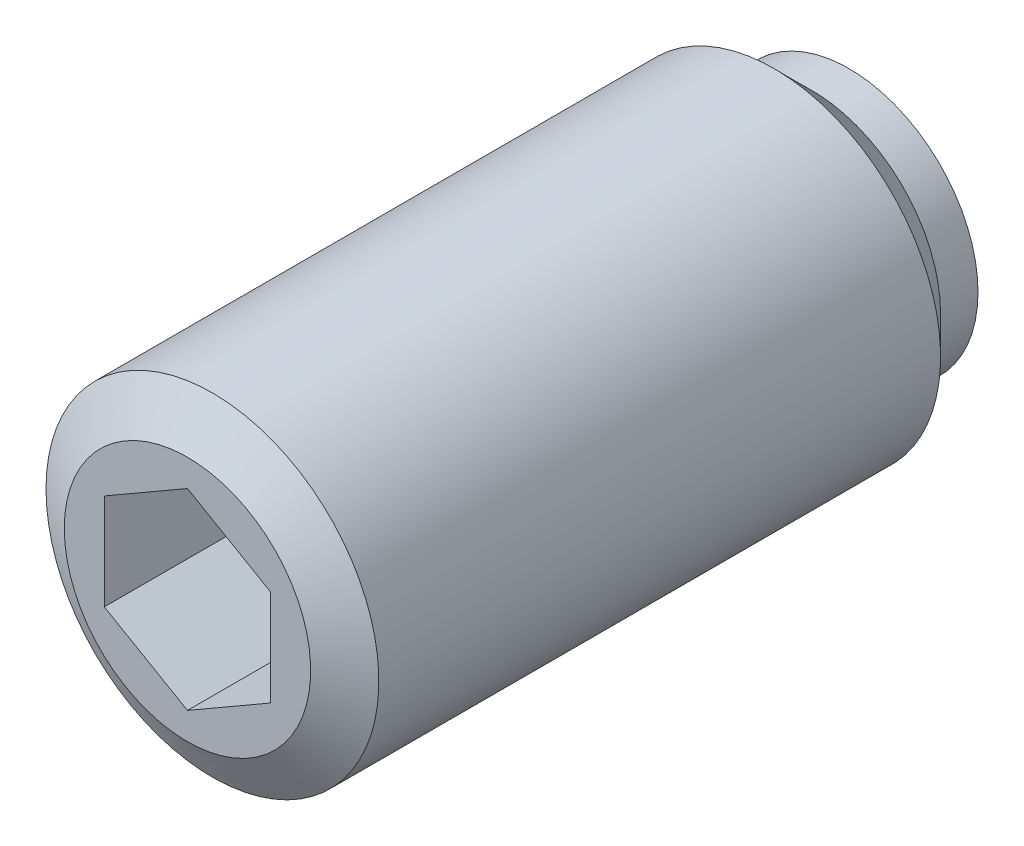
ISO-10303-21;
HEADER;
FILE_DESCRIPTION(('STEP AP214'),'2;1');
FILE_NAME('part.step','',(''),(''),'','','');
FILE_SCHEMA(('AUTOMOTIVE_DESIGN { 1 0 10303 214 1 1 1 1 }'));
ENDSEC;
DATA;
#1=APPLICATION_CONTEXT('core data for automotive mechanical design processes');
#2=APPLICATION_PROTOCOL_DEFINITION('international standard','automotive_design',2000,#1);
#3=PRODUCT_CONTEXT('',#1,'mechanical');
#4=PRODUCT('Part','Part','',(#3));
#5=PRODUCT_RELATED_PRODUCT_CATEGORY('part','',(#4));
#6=PRODUCT_DEFINITION_FORMATION('','',#4);
#7=PRODUCT_DEFINITION_CONTEXT('part definition',#1,'design');
#8=PRODUCT_DEFINITION('design','',#6,#7);
#9=PRODUCT_DEFINITION_SHAPE('','',#8);
#10=(LENGTH_UNIT() NAMED_UNIT(*) SI_UNIT(.MILLI.,.METRE.));
#11=(NAMED_UNIT(*) PLANE_ANGLE_UNIT() SI_UNIT($,.RADIAN.));
#12=(NAMED_UNIT(*) SI_UNIT($,.STERADIAN.) SOLID_ANGLE_UNIT());
#13=UNCERTAINTY_MEASURE_WITH_UNIT(LENGTH_MEASURE(1.E-05),#10,'distance_accuracy_value','');
#14=(GEOMETRIC_REPRESENTATION_CONTEXT(3) GLOBAL_UNCERTAINTY_ASSIGNED_CONTEXT((#13)) GLOBAL_UNIT_ASSIGNED_CONTEXT((#10,
#11,#12)) REPRESENTATION_CONTEXT('',''));
#15=CARTESIAN_POINT('',(0.,0.,0.));
#16=DIRECTION('',(0.,0.,1.));
#17=DIRECTION('',(1.,0.,0.));
#18=AXIS2_PLACEMENT_3D('',#15,#16,#17);
#19=CARTESIAN_POINT('',(0.,2.09621086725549,0.));
#20=DIRECTION('',(0.,0.,1.));
#21=DIRECTION('',(-1.,0.,0.));
#22=AXIS2_PLACEMENT_3D('',#19,#20,#21);
#23=PLANE('',#22);
#24=CARTESIAN_POINT('',(0.,0.,0.));
#25=DIRECTION('',(0.,0.,1.));
#26=DIRECTION('',(-1.,0.,0.));
#27=AXIS2_PLACEMENT_3D('',#24,#25,#26);
#28=CIRCLE('',#27,2.09621086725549);
#29=CARTESIAN_POINT('',(0.,2.09621086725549,0.));
#30=VERTEX_POINT('',#29);
#31=EDGE_CURVE('E9',#30,#30,#28,.T.);
#32=ORIENTED_EDGE('',*,*,#31,.F.);
#33=EDGE_LOOP('',(#32));
#34=FACE_BOUND('',#33,.T.);
#35=ADVANCED_FACE('F14',(#34),#23,.F.);
#36=CARTESIAN_POINT('',(0.,0.,1.78));
#37=DIRECTION('',(0.,0.,1.));
#38=DIRECTION('',(0.,1.,0.));
#39=AXIS2_PLACEMENT_3D('',#36,#37,#38);
#40=SPHERICAL_SURFACE('',#39,2.75);
#41=CARTESIAN_POINT('',(0.,0.,0.5));
#42=DIRECTION('',(0.,0.,1.));
#43=DIRECTION('',(-1.,0.,0.));
#44=AXIS2_PLACEMENT_3D('',#41,#42,#43);
#45=CIRCLE('',#44,2.43394741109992);
#46=CARTESIAN_POINT('',(0.,2.43394741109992,0.5));
#47=VERTEX_POINT('',#46);
#48=EDGE_CURVE('E21',#47,#47,#45,.T.);
#49=CARTESIAN_POINT('',(0.,2.43394741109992,0.5));
#50=CARTESIAN_POINT('',(0.,2.43101603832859,0.494425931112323));
#51=CARTESIAN_POINT('',(0.,2.42806551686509,0.488861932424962));
#52=CARTESIAN_POINT('',(0.,2.42212631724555,0.477754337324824));
#53=CARTESIAN_POINT('',(0.,2.41913763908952,0.472210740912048));
#54=CARTESIAN_POINT('',(0.,2.41312226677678,0.46114421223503));
#55=CARTESIAN_POINT('',(0.,2.41009557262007,0.455621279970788));
#56=CARTESIAN_POINT('',(0.,2.40400431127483,0.444596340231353));
#57=CARTESIAN_POINT('',(0.,2.40093974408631,0.439094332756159));
#58=CARTESIAN_POINT('',(0.,2.39477288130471,0.428111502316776));
#59=CARTESIAN_POINT('',(0.,2.39167058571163,0.422630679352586));
#60=CARTESIAN_POINT('',(0.,2.38542841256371,0.411690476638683));
#61=CARTESIAN_POINT('',(0.,2.38228853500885,0.40623109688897));
#62=CARTESIAN_POINT('',(0.,2.37597134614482,0.39533403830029));
#63=CARTESIAN_POINT('',(0.,2.37279403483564,0.389896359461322));
#64=CARTESIAN_POINT('',(0.,2.36640212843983,0.379042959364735));
#65=CARTESIAN_POINT('',(0.,2.3631875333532,0.373627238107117));
#66=CARTESIAN_POINT('',(0.,2.35672121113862,0.362818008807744));
#67=CARTESIAN_POINT('',(0.,2.35346948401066,0.35742450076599));
#68=CARTESIAN_POINT('',(0.,2.3469290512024,0.346659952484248));
#69=CARTESIAN_POINT('',(0.,2.3436403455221,0.341288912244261));
#70=CARTESIAN_POINT('',(0.,2.3370261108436,0.330569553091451));
#71=CARTESIAN_POINT('',(0.,2.33370058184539,0.325221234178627));
#72=CARTESIAN_POINT('',(0.,2.32701285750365,0.314547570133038));
#73=CARTESIAN_POINT('',(0.,2.32365066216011,0.309222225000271));
#74=CARTESIAN_POINT('',(0.,2.31688976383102,0.298594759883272));
#75=CARTESIAN_POINT('',(0.,2.31349106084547,0.293292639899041));
#76=CARTESIAN_POINT('',(0.,2.30665730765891,0.28271187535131));
#77=CARTESIAN_POINT('',(0.,2.30322225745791,0.277433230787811));
#78=CARTESIAN_POINT('',(0.,2.29631597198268,0.266899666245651));
#79=CARTESIAN_POINT('',(0.,2.29284473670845,0.261644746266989));
#80=CARTESIAN_POINT('',(0.,2.28586624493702,0.251158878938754));
#81=CARTESIAN_POINT('',(0.,2.28235898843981,0.24592793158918));
#82=CARTESIAN_POINT('',(0.,2.27530861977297,0.235490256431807));
#83=CARTESIAN_POINT('',(0.,2.27176550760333,0.230283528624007));
#84=CARTESIAN_POINT('',(0.,2.26464359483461,0.219894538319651));
#85=CARTESIAN_POINT('',(0.,2.26106479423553,0.214712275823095));
#86=CARTESIAN_POINT('',(0.,2.25387167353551,0.204372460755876));
#87=CARTESIAN_POINT('',(0.,2.25025735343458,0.199214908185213));
#88=CARTESIAN_POINT('',(0.,2.24299336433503,0.188924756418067));
#89=CARTESIAN_POINT('',(0.,2.23934369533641,0.183792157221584));
#90=CARTESIAN_POINT('',(0.,2.23200918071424,0.173552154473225));
#91=CARTESIAN_POINT('',(0.,2.22832433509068,0.168444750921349));
#92=CARTESIAN_POINT('',(0.,2.22091964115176,0.158255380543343));
#93=CARTESIAN_POINT('',(0.,2.2171997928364,0.153173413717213));
#94=CARTESIAN_POINT('',(0.,2.20972526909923,0.143035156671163));
#95=CARTESIAN_POINT('',(0.,2.20597059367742,0.137978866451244));
#96=CARTESIAN_POINT('',(0.,2.19842659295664,0.127892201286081));
#97=CARTESIAN_POINT('',(0.,2.19463726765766,0.122861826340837));
#98=CARTESIAN_POINT('',(0.,2.18702414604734,0.112827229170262));
#99=CARTESIAN_POINT('',(0.,2.183200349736,0.10782300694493));
#100=CARTESIAN_POINT('',(0.,2.17551846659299,0.0978409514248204));
#101=CARTESIAN_POINT('',(0.,2.17166037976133,0.0928631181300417));
#102=CARTESIAN_POINT('',(0.,2.16391009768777,0.0829340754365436));
#103=CARTESIAN_POINT('',(0.,2.16001790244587,0.0779828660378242));
#104=CARTESIAN_POINT('',(0.,2.15219958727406,0.0681073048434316));
#105=CARTESIAN_POINT('',(0.,2.14827346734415,0.0631829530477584));
#106=CARTESIAN_POINT('',(0.,2.14038748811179,0.0533613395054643));
#107=CARTESIAN_POINT('',(0.,2.13642762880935,0.0484640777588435));
#108=CARTESIAN_POINT('',(0.,2.12847435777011,0.0386968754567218));
#109=CARTESIAN_POINT('',(0.,2.12448094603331,0.0338269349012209));
#110=CARTESIAN_POINT('',(0.,2.11646075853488,0.024114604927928));
#111=CARTESIAN_POINT('',(0.,2.11243398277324,0.019272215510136));
#112=CARTESIAN_POINT('',(0.,2.10434725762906,0.0096152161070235));
#113=CARTESIAN_POINT('',(0.,2.10028730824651,0.00480060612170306));
#114=CARTESIAN_POINT('',(0.,2.09621086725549,0.));
#115=B_SPLINE_CURVE_WITH_KNOTS('',3,(#49,#50,#51,#52,#53,#54,#55,#56,#57,#58,#59,#60,#61,#62,
#63,#64,#65,#66,#67,#68,#69,#70,#71,#72,#73,#74,#75,#76,#77,#78,#79,#80,#81,#82,#83,#84,#85,#86,
#87,#88,#89,#90,#91,#92,#93,#94,#95,#96,#97,#98,#99,#100,#101,#102,#103,#104,#105,#106,#107,
#108,#109,#110,#111,#112,#113,#114),.UNSPECIFIED.,.F.,.F.,(4,2,2,2,2,2,2,2,2,2,2,2,2,2,2,2,2,2,
2,2,2,2,2,2,2,2,2,2,2,2,2,2,4),(0.,0.0188935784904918,0.0377871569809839,0.0566807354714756,
0.0755743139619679,0.0944678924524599,0.113361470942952,0.132255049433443,0.151148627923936,
0.170042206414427,0.188935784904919,0.207829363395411,0.226722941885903,0.245616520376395,
0.264510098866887,0.283403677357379,0.302297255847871,0.321190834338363,0.340084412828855,
0.358977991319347,0.377871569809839,0.396765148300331,0.415658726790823,0.434552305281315,
0.453445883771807,0.472339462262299,0.491233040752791,0.510126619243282,0.529020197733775,
0.547913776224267,0.566807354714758,0.58570093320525,0.604594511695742),.UNSPECIFIED.);
#116=EDGE_CURVE('BSEAM141',#47,#30,#115,.T.);
#117=ORIENTED_EDGE('',*,*,#48,.F.);
#118=ORIENTED_EDGE('',*,*,#31,.T.);
#119=ORIENTED_EDGE('',*,*,#116,.T.);
#120=ORIENTED_EDGE('',*,*,#116,.F.);
#121=EDGE_LOOP('',(#117,#119,#118,#120));
#122=FACE_BOUND('',#121,.T.);
#123=ADVANCED_FACE('F141',(#122),#40,.T.);
#124=CARTESIAN_POINT('',(0.,3.1,0.5));
#125=DIRECTION('',(0.,0.,1.));
#126=DIRECTION('',(-1.,0.,0.));
#127=AXIS2_PLACEMENT_3D('',#124,#125,#126);
#128=PLANE('',#127);
#129=CARTESIAN_POINT('',(0.,0.,0.5));
#130=DIRECTION('',(0.,0.,1.));
#131=DIRECTION('',(-1.,0.,0.));
#132=AXIS2_PLACEMENT_3D('',#129,#130,#131);
#133=CIRCLE('',#132,3.1);
#134=CARTESIAN_POINT('',(-3.1,0.,0.5));
#135=VERTEX_POINT('',#134);
#136=EDGE_CURVE('E134',#135,#135,#133,.T.);
#137=ORIENTED_EDGE('',*,*,#136,.F.);
#138=EDGE_LOOP('',(#137));
#139=FACE_BOUND('',#138,.T.);
#140=ORIENTED_EDGE('',*,*,#48,.T.);
#141=EDGE_LOOP('',(#140));
#142=FACE_BOUND('',#141,.T.);
#143=ADVANCED_FACE('F139',(#139,#142),#128,.F.);
#144=CARTESIAN_POINT('',(0.,0.,17.7950749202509));
#145=DIRECTION('',(0.,0.,1.));
#146=DIRECTION('',(-1.,0.,0.));
#147=AXIS2_PLACEMENT_3D('',#144,#145,#146);
#148=CYLINDRICAL_SURFACE('',#147,3.1);
#149=CARTESIAN_POINT('',(0.,0.,1.4));
#150=DIRECTION('',(0.,0.,1.));
#151=DIRECTION('',(-1.,0.,0.));
#152=AXIS2_PLACEMENT_3D('',#149,#150,#151);
#153=CIRCLE('',#152,3.1);
#154=CARTESIAN_POINT('',(-3.1,0.,1.4));
#155=VERTEX_POINT('',#154);
#156=EDGE_CURVE('E131',#155,#155,#153,.T.);
#157=ORIENTED_EDGE('',*,*,#156,.F.);
#158=EDGE_LOOP('',(#157));
#159=FACE_BOUND('',#158,.T.);
#160=ORIENTED_EDGE('',*,*,#136,.T.);
#161=EDGE_LOOP('',(#160));
#162=FACE_BOUND('',#161,.T.);
#163=ADVANCED_FACE('F164',(#159,#162),#148,.T.);
#164=CARTESIAN_POINT('',(0.,0.,1.4));
#165=DIRECTION('',(0.,0.,1.));
#166=DIRECTION('',(-1.,0.,0.));
#167=AXIS2_PLACEMENT_3D('',#164,#165,#166);
#168=CONICAL_SURFACE('',#167,3.1,0.78539816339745);
#169=CARTESIAN_POINT('',(0.,0.,2.3));
#170=DIRECTION('',(0.,0.,1.));
#171=DIRECTION('',(-1.,0.,0.));
#172=AXIS2_PLACEMENT_3D('',#169,#170,#171);
#173=CIRCLE('',#172,4.);
#174=CARTESIAN_POINT('',(-4.,0.,2.3));
#175=VERTEX_POINT('',#174);
#176=EDGE_CURVE('E128',#175,#175,#173,.T.);
#177=ORIENTED_EDGE('',*,*,#176,.F.);
#178=EDGE_LOOP('',(#177));
#179=FACE_BOUND('',#178,.T.);
#180=ORIENTED_EDGE('',*,*,#156,.T.);
#181=EDGE_LOOP('',(#180));
#182=FACE_BOUND('',#181,.T.);
#183=ADVANCED_FACE('F173',(#179,#182),#168,.T.);
#184=CARTESIAN_POINT('',(0.,0.,17.7950749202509));
#185=DIRECTION('',(0.,0.,1.));
#186=DIRECTION('',(-1.,0.,0.));
#187=AXIS2_PLACEMENT_3D('',#184,#185,#186);
#188=CYLINDRICAL_SURFACE('',#187,4.);
#189=CARTESIAN_POINT('',(0.,0.,15.8));
#190=DIRECTION('',(0.,0.,1.));
#191=DIRECTION('',(-1.,0.,0.));
#192=AXIS2_PLACEMENT_3D('',#189,#190,#191);
#193=CIRCLE('',#192,4.);
#194=CARTESIAN_POINT('',(-4.,0.,15.8));
#195=VERTEX_POINT('',#194);
#196=EDGE_CURVE('E125',#195,#195,#193,.T.);
#197=ORIENTED_EDGE('',*,*,#196,.F.);
#198=EDGE_LOOP('',(#197));
#199=FACE_BOUND('',#198,.T.);
#200=ORIENTED_EDGE('',*,*,#176,.T.);
#201=EDGE_LOOP('',(#200));
#202=FACE_BOUND('',#201,.T.);
#203=ADVANCED_FACE('F182',(#199,#202),#188,.T.);
#204=CARTESIAN_POINT('',(0.,0.,15.8));
#205=DIRECTION('',(0.,0.,-1.));
#206=DIRECTION('',(1.,0.,0.));
#207=AXIS2_PLACEMENT_3D('',#204,#205,#206);
#208=CONICAL_SURFACE('',#207,4.,1.04719755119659);
#209=CARTESIAN_POINT('',(0.,0.,16.4));
#210=DIRECTION('',(0.,0.,1.));
#211=DIRECTION('',(-1.,0.,0.));
#212=AXIS2_PLACEMENT_3D('',#209,#210,#211);
#213=CIRCLE('',#212,2.9607695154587);
#214=CARTESIAN_POINT('',(-2.9607695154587,0.,16.4));
#215=VERTEX_POINT('',#214);
#216=EDGE_CURVE('E116',#215,#215,#213,.T.);
#217=ORIENTED_EDGE('',*,*,#216,.F.);
#218=EDGE_LOOP('',(#217));
#219=FACE_BOUND('',#218,.T.);
#220=ORIENTED_EDGE('',*,*,#196,.T.);
#221=EDGE_LOOP('',(#220));
#222=FACE_BOUND('',#221,.T.);
#223=ADVANCED_FACE('F191',(#219,#222),#208,.T.);
#224=CARTESIAN_POINT('',(0.,0.,16.4));
#225=DIRECTION('',(0.,0.,-1.));
#226=DIRECTION('',(1.,0.,0.));
#227=AXIS2_PLACEMENT_3D('',#224,#225,#226);
#228=PLANE('',#227);
#229=DIRECTION('',(-0.866025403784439,-0.5,0.));
#230=VECTOR('',#229,1.);
#231=CARTESIAN_POINT('',(0.,2.30940107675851,16.4));
#232=LINE('',#231,#230);
#233=CARTESIAN_POINT('',(0.,2.30940107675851,16.4));
#234=VERTEX_POINT('',#233);
#235=CARTESIAN_POINT('',(-2.,1.15470053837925,16.4));
#236=VERTEX_POINT('',#235);
#237=EDGE_CURVE('E82',#234,#236,#232,.T.);
#238=ORIENTED_EDGE('',*,*,#237,.F.);
#239=DIRECTION('',(-0.866025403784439,0.5,0.));
#240=VECTOR('',#239,1.);
#241=CARTESIAN_POINT('',(2.,1.15470053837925,16.4));
#242=LINE('',#241,#240);
#243=CARTESIAN_POINT('',(2.,1.15470053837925,16.4));
#244=VERTEX_POINT('',#243);
#245=EDGE_CURVE('E28',#244,#234,#242,.T.);
#246=ORIENTED_EDGE('',*,*,#245,.F.);
#247=DIRECTION('',(0.,1.,0.));
#248=VECTOR('',#247,1.);
#249=CARTESIAN_POINT('',(2.,-1.15470053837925,16.4));
#250=LINE('',#249,#248);
#251=CARTESIAN_POINT('',(2.,-1.15470053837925,16.4));
#252=VERTEX_POINT('',#251);
#253=EDGE_CURVE('E98',#252,#244,#250,.T.);
#254=ORIENTED_EDGE('',*,*,#253,.F.);
#255=DIRECTION('',(0.866025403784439,0.5,0.));
#256=VECTOR('',#255,1.);
#257=CARTESIAN_POINT('',(0.,-2.30940107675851,16.4));
#258=LINE('',#257,#256);
#259=CARTESIAN_POINT('',(0.,-2.30940107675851,16.4));
#260=VERTEX_POINT('',#259);
#261=EDGE_CURVE('E92',#260,#252,#258,.T.);
#262=ORIENTED_EDGE('',*,*,#261,.F.);
#263=DIRECTION('',(0.866025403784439,-0.5,0.));
#264=VECTOR('',#263,1.);
#265=CARTESIAN_POINT('',(-2.,-1.15470053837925,16.4));
#266=LINE('',#265,#264);
#267=CARTESIAN_POINT('',(-2.,-1.15470053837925,16.4));
#268=VERTEX_POINT('',#267);
#269=EDGE_CURVE('E90',#268,#260,#266,.T.);
#270=ORIENTED_EDGE('',*,*,#269,.F.);
#271=DIRECTION('',(0.,-1.,0.));
#272=VECTOR('',#271,1.);
#273=CARTESIAN_POINT('',(-2.,1.15470053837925,16.4));
#274=LINE('',#273,#272);
#275=EDGE_CURVE('E71',#236,#268,#274,.T.);
#276=ORIENTED_EDGE('',*,*,#275,.F.);
#277=EDGE_LOOP('',(#238,#246,#254,#262,#270,#276));
#278=FACE_BOUND('',#277,.T.);
#279=ORIENTED_EDGE('',*,*,#216,.T.);
#280=EDGE_LOOP('',(#279));
#281=FACE_BOUND('',#280,.T.);
#282=ADVANCED_FACE('F86',(#278,#281),#228,.F.);
#283=CARTESIAN_POINT('',(2.,1.15470053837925,12.4));
#284=DIRECTION('',(0.5,0.866025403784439,0.));
#285=DIRECTION('',(0.866025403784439,-0.5,0.));
#286=AXIS2_PLACEMENT_3D('',#283,#284,#285);
#287=PLANE('',#286);
#288=ORIENTED_EDGE('',*,*,#245,.T.);
#289=DIRECTION('',(0.,0.,1.));
#290=VECTOR('',#289,1.);
#291=CARTESIAN_POINT('',(0.,2.30940107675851,12.4));
#292=LINE('',#291,#290);
#293=CARTESIAN_POINT('',(0.,2.30940107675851,12.4));
#294=VERTEX_POINT('',#293);
#295=EDGE_CURVE('E79',#294,#234,#292,.T.);
#296=ORIENTED_EDGE('',*,*,#295,.F.);
#297=DIRECTION('',(-0.866025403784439,0.5,0.));
#298=VECTOR('',#297,1.);
#299=CARTESIAN_POINT('',(2.,1.15470053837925,12.4));
#300=LINE('',#299,#298);
#301=CARTESIAN_POINT('',(2.,1.15470053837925,12.4));
#302=VERTEX_POINT('',#301);
#303=EDGE_CURVE('E100',#302,#294,#300,.T.);
#304=ORIENTED_EDGE('',*,*,#303,.F.);
#305=DIRECTION('',(0.,0.,1.));
#306=VECTOR('',#305,1.);
#307=CARTESIAN_POINT('',(2.,1.15470053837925,12.4));
#308=LINE('',#307,#306);
#309=EDGE_CURVE('E35',#302,#244,#308,.T.);
#310=ORIENTED_EDGE('',*,*,#309,.T.);
#311=EDGE_LOOP('',(#288,#296,#304,#310));
#312=FACE_BOUND('',#311,.T.);
#313=ADVANCED_FACE('F208',(#312),#287,.F.);
#314=CARTESIAN_POINT('',(2.,-1.15470053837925,12.4));
#315=DIRECTION('',(1.,0.,0.));
#316=DIRECTION('',(0.,0.,1.));
#317=AXIS2_PLACEMENT_3D('',#314,#315,#316);
#318=PLANE('',#317);
#319=ORIENTED_EDGE('',*,*,#253,.T.);
#320=ORIENTED_EDGE('',*,*,#309,.F.);
#321=DIRECTION('',(0.,1.,0.));
#322=VECTOR('',#321,1.);
#323=CARTESIAN_POINT('',(2.,-1.15470053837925,12.4));
#324=LINE('',#323,#322);
#325=CARTESIAN_POINT('',(2.,-1.15470053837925,12.4));
#326=VERTEX_POINT('',#325);
#327=EDGE_CURVE('E112',#326,#302,#324,.T.);
#328=ORIENTED_EDGE('',*,*,#327,.F.);
#329=DIRECTION('',(0.,0.,1.));
#330=VECTOR('',#329,1.);
#331=CARTESIAN_POINT('',(2.,-1.15470053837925,12.4));
#332=LINE('',#331,#330);
#333=EDGE_CURVE('E117',#326,#252,#332,.T.);
#334=ORIENTED_EDGE('',*,*,#333,.T.);
#335=EDGE_LOOP('',(#319,#320,#328,#334));
#336=FACE_BOUND('',#335,.T.);
#337=ADVANCED_FACE('F216',(#336),#318,.F.);
#338=CARTESIAN_POINT('',(0.,-2.30940107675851,12.4));
#339=DIRECTION('',(0.5,-0.866025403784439,0.));
#340=DIRECTION('',(-0.866025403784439,-0.5,0.));
#341=AXIS2_PLACEMENT_3D('',#338,#339,#340);
#342=PLANE('',#341);
#343=ORIENTED_EDGE('',*,*,#261,.T.);
#344=ORIENTED_EDGE('',*,*,#333,.F.);
#345=DIRECTION('',(0.866025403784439,0.5,0.));
#346=VECTOR('',#345,1.);
#347=CARTESIAN_POINT('',(0.,-2.30940107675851,12.4));
#348=LINE('',#347,#346);
#349=CARTESIAN_POINT('',(0.,-2.30940107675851,12.4));
#350=VERTEX_POINT('',#349);
#351=EDGE_CURVE('E109',#350,#326,#348,.T.);
#352=ORIENTED_EDGE('',*,*,#351,.F.);
#353=DIRECTION('',(0.,0.,1.));
#354=VECTOR('',#353,1.);
#355=CARTESIAN_POINT('',(0.,-2.30940107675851,12.4));
#356=LINE('',#355,#354);
#357=EDGE_CURVE('E119',#350,#260,#356,.T.);
#358=ORIENTED_EDGE('',*,*,#357,.T.);
#359=EDGE_LOOP('',(#343,#344,#352,#358));
#360=FACE_BOUND('',#359,.T.);
#361=ADVANCED_FACE('F224',(#360),#342,.F.);
#362=CARTESIAN_POINT('',(-2.,-1.15470053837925,12.4));
#363=DIRECTION('',(-0.5,-0.866025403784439,0.));
#364=DIRECTION('',(-0.866025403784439,0.5,0.));
#365=AXIS2_PLACEMENT_3D('',#362,#363,#364);
#366=PLANE('',#365);
#367=ORIENTED_EDGE('',*,*,#269,.T.);
#368=ORIENTED_EDGE('',*,*,#357,.F.);
#369=DIRECTION('',(0.866025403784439,-0.5,0.));
#370=VECTOR('',#369,1.);
#371=CARTESIAN_POINT('',(-2.,-1.15470053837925,12.4));
#372=LINE('',#371,#370);
#373=CARTESIAN_POINT('',(-2.,-1.15470053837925,12.4));
#374=VERTEX_POINT('',#373);
#375=EDGE_CURVE('E106',#374,#350,#372,.T.);
#376=ORIENTED_EDGE('',*,*,#375,.F.);
#377=DIRECTION('',(0.,0.,1.));
#378=VECTOR('',#377,1.);
#379=CARTESIAN_POINT('',(-2.,-1.15470053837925,12.4));
#380=LINE('',#379,#378);
#381=EDGE_CURVE('E78',#374,#268,#380,.T.);
#382=ORIENTED_EDGE('',*,*,#381,.T.);
#383=EDGE_LOOP('',(#367,#368,#376,#382));
#384=FACE_BOUND('',#383,.T.);
#385=ADVANCED_FACE('F232',(#384),#366,.F.);
#386=CARTESIAN_POINT('',(-2.,1.15470053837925,12.4));
#387=DIRECTION('',(-1.,0.,0.));
#388=DIRECTION('',(0.,1.,0.));
#389=AXIS2_PLACEMENT_3D('',#386,#387,#388);
#390=PLANE('',#389);
#391=ORIENTED_EDGE('',*,*,#275,.T.);
#392=ORIENTED_EDGE('',*,*,#381,.F.);
#393=DIRECTION('',(0.,-1.,0.));
#394=VECTOR('',#393,1.);
#395=CARTESIAN_POINT('',(-2.,1.15470053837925,12.4));
#396=LINE('',#395,#394);
#397=CARTESIAN_POINT('',(-2.,1.15470053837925,12.4));
#398=VERTEX_POINT('',#397);
#399=EDGE_CURVE('E74',#398,#374,#396,.T.);
#400=ORIENTED_EDGE('',*,*,#399,.F.);
#401=DIRECTION('',(0.,0.,1.));
#402=VECTOR('',#401,1.);
#403=CARTESIAN_POINT('',(-2.,1.15470053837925,12.4));
#404=LINE('',#403,#402);
#405=EDGE_CURVE('E67',#398,#236,#404,.T.);
#406=ORIENTED_EDGE('',*,*,#405,.T.);
#407=EDGE_LOOP('',(#391,#392,#400,#406));
#408=FACE_BOUND('',#407,.T.);
#409=ADVANCED_FACE('F69',(#408),#390,.F.);
#410=CARTESIAN_POINT('',(0.,2.30940107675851,12.4));
#411=DIRECTION('',(-0.5,0.866025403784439,0.));
#412=DIRECTION('',(0.866025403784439,0.5,0.));
#413=AXIS2_PLACEMENT_3D('',#410,#411,#412);
#414=PLANE('',#413);
#415=ORIENTED_EDGE('',*,*,#237,.T.);
#416=ORIENTED_EDGE('',*,*,#405,.F.);
#417=DIRECTION('',(-0.866025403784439,-0.5,0.));
#418=VECTOR('',#417,1.);
#419=CARTESIAN_POINT('',(0.,2.30940107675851,12.4));
#420=LINE('',#419,#418);
#421=EDGE_CURVE('E103',#294,#398,#420,.T.);
#422=ORIENTED_EDGE('',*,*,#421,.F.);
#423=ORIENTED_EDGE('',*,*,#295,.T.);
#424=EDGE_LOOP('',(#415,#416,#422,#423));
#425=FACE_BOUND('',#424,.T.);
#426=ADVANCED_FACE('F83',(#425),#414,.F.);
#427=CARTESIAN_POINT('',(2.,1.15470053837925,12.4));
#428=DIRECTION('',(0.,0.,-1.));
#429=DIRECTION('',(1.,0.,0.));
#430=AXIS2_PLACEMENT_3D('',#427,#428,#429);
#431=PLANE('',#430);
#432=ORIENTED_EDGE('',*,*,#303,.T.);
#433=ORIENTED_EDGE('',*,*,#421,.T.);
#434=ORIENTED_EDGE('',*,*,#399,.T.);
#435=ORIENTED_EDGE('',*,*,#375,.T.);
#436=ORIENTED_EDGE('',*,*,#351,.T.);
#437=ORIENTED_EDGE('',*,*,#327,.T.);
#438=EDGE_LOOP('',(#432,#433,#434,#435,#436,#437));
#439=FACE_BOUND('',#438,.T.);
#440=ADVANCED_FACE('F256',(#439),#431,.F.);
#441=CLOSED_SHELL('',(#35,#123,#143,#163,#183,#203,#223,#282,#313,#337,#361,#385,#409,#426,#440));
#442=MANIFOLD_SOLID_BREP('B1',#441);
#443=ADVANCED_BREP_SHAPE_REPRESENTATION('',(#18,#442),#14);
#444=SHAPE_DEFINITION_REPRESENTATION(#9,#443);
ENDSEC;
END-ISO-10303-21;
